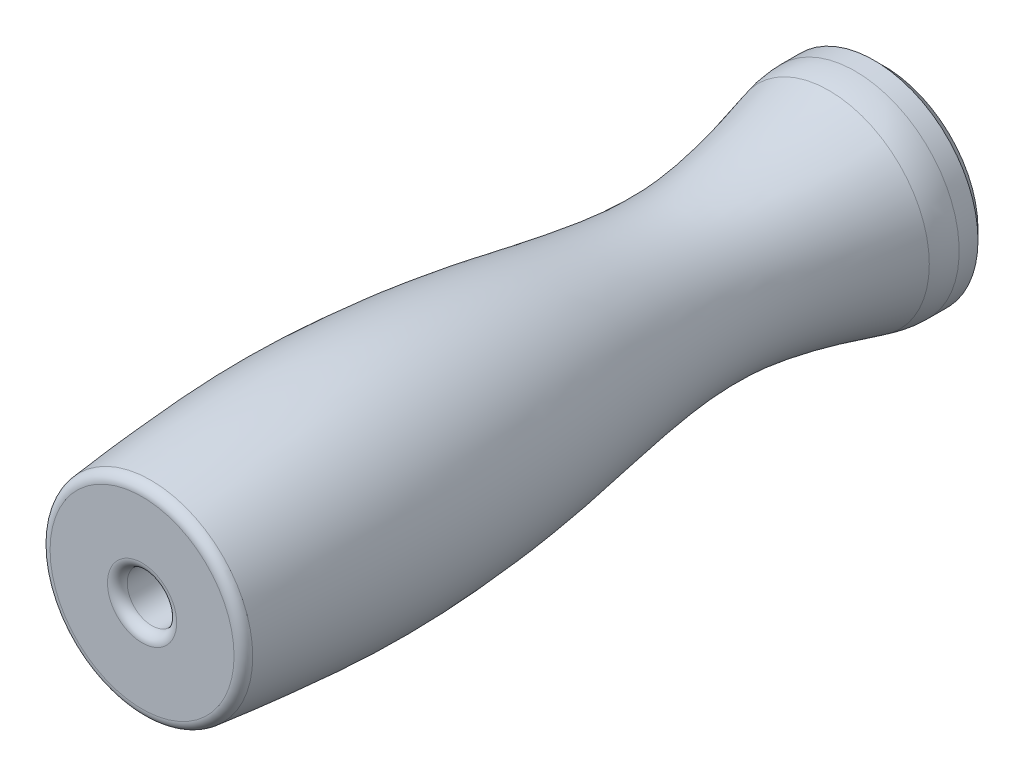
ISO-10303-21;
HEADER;
FILE_DESCRIPTION(('STEP AP214'),'2;1');
FILE_NAME('part.step','',(''),(''),'','','');
FILE_SCHEMA(('AUTOMOTIVE_DESIGN { 1 0 10303 214 1 1 1 1 }'));
ENDSEC;
DATA;
#1=APPLICATION_CONTEXT('core data for automotive mechanical design processes');
#2=APPLICATION_PROTOCOL_DEFINITION('international standard','automotive_design',2000,#1);
#3=PRODUCT_CONTEXT('',#1,'mechanical');
#4=PRODUCT('Part','Part','',(#3));
#5=PRODUCT_RELATED_PRODUCT_CATEGORY('part','',(#4));
#6=PRODUCT_DEFINITION_FORMATION('','',#4);
#7=PRODUCT_DEFINITION_CONTEXT('part definition',#1,'design');
#8=PRODUCT_DEFINITION('design','',#6,#7);
#9=PRODUCT_DEFINITION_SHAPE('','',#8);
#10=(LENGTH_UNIT() NAMED_UNIT(*) SI_UNIT(.MILLI.,.METRE.));
#11=(NAMED_UNIT(*) PLANE_ANGLE_UNIT() SI_UNIT($,.RADIAN.));
#12=(NAMED_UNIT(*) SI_UNIT($,.STERADIAN.) SOLID_ANGLE_UNIT());
#13=UNCERTAINTY_MEASURE_WITH_UNIT(LENGTH_MEASURE(1.E-05),#10,'distance_accuracy_value','');
#14=(GEOMETRIC_REPRESENTATION_CONTEXT(3) GLOBAL_UNCERTAINTY_ASSIGNED_CONTEXT((#13)) GLOBAL_UNIT_ASSIGNED_CONTEXT((#10,
#11,#12)) REPRESENTATION_CONTEXT('',''));
#15=CARTESIAN_POINT('',(0.,0.,0.));
#16=DIRECTION('',(0.,0.,1.));
#17=DIRECTION('',(1.,0.,0.));
#18=AXIS2_PLACEMENT_3D('',#15,#16,#17);
#19=CARTESIAN_POINT('',(0.,0.,2.90364135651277));
#20=DIRECTION('',(0.,0.,-1.));
#21=DIRECTION('',(-1.,0.,0.));
#22=AXIS2_PLACEMENT_3D('',#19,#20,#21);
#23=DEGENERATE_TOROIDAL_SURFACE('',#22,0.500000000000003,10.,.T.);
#24=CARTESIAN_POINT('',(0.,0.,5.5629508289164));
#25=DIRECTION('',(0.,0.,-1.));
#26=DIRECTION('',(-1.,0.,0.));
#27=AXIS2_PLACEMENT_3D('',#24,#25,#26);
#28=CIRCLE('',#27,10.1399208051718);
#29=CARTESIAN_POINT('',(-10.1399208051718,0.,5.5629508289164));
#30=VERTEX_POINT('',#29);
#31=EDGE_CURVE('E57',#30,#30,#28,.F.);
#32=ORIENTED_EDGE('',*,*,#31,.F.);
#33=EDGE_LOOP('',(#32));
#34=FACE_BOUND('',#33,.T.);
#35=CARTESIAN_POINT('',(0.,0.,2.90364135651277));
#36=DIRECTION('',(0.,0.,-1.));
#37=DIRECTION('',(-1.,0.,0.));
#38=AXIS2_PLACEMENT_3D('',#35,#36,#37);
#39=CIRCLE('',#38,10.5);
#40=CARTESIAN_POINT('',(-10.5,0.,2.90364135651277));
#41=VERTEX_POINT('',#40);
#42=EDGE_CURVE('E54',#41,#41,#39,.T.);
#43=ORIENTED_EDGE('',*,*,#42,.F.);
#44=EDGE_LOOP('',(#43));
#45=FACE_BOUND('',#44,.T.);
#46=ADVANCED_FACE('F29',(#34,#45),#23,.T.);
#47=CARTESIAN_POINT('',(0.,0.,75.));
#48=DIRECTION('',(0.,0.,1.));
#49=DIRECTION('',(1.,0.,0.));
#50=AXIS2_PLACEMENT_3D('',#47,#48,#49);
#51=PLANE('',#50);
#52=CARTESIAN_POINT('',(0.,0.,75.));
#53=DIRECTION('',(0.,0.,1.));
#54=DIRECTION('',(1.,0.,0.));
#55=AXIS2_PLACEMENT_3D('',#52,#53,#54);
#56=CIRCLE('',#55,9.29819046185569);
#57=CARTESIAN_POINT('',(9.29819046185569,0.,75.));
#58=VERTEX_POINT('',#57);
#59=EDGE_CURVE('E39',#58,#58,#56,.T.);
#60=ORIENTED_EDGE('',*,*,#59,.T.);
#61=EDGE_LOOP('',(#60));
#62=FACE_BOUND('',#61,.T.);
#63=CARTESIAN_POINT('',(0.,0.,75.));
#64=DIRECTION('',(0.,0.,1.));
#65=DIRECTION('',(1.,0.,0.));
#66=AXIS2_PLACEMENT_3D('',#63,#64,#65);
#67=CIRCLE('',#66,3.5);
#68=CARTESIAN_POINT('',(3.5,0.,75.));
#69=VERTEX_POINT('',#68);
#70=EDGE_CURVE('E43',#69,#69,#67,.F.);
#71=ORIENTED_EDGE('',*,*,#70,.T.);
#72=EDGE_LOOP('',(#71));
#73=FACE_BOUND('',#72,.T.);
#74=ADVANCED_FACE('F80',(#62,#73),#51,.T.);
#75=CARTESIAN_POINT('',(0.,0.,5.));
#76=DIRECTION('',(0.,0.,-1.));
#77=DIRECTION('',(-1.,0.,0.));
#78=AXIS2_PLACEMENT_3D('',#75,#76,#77);
#79=CYLINDRICAL_SURFACE('',#78,10.5);
#80=CARTESIAN_POINT('',(0.,0.,1.00000000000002));
#81=DIRECTION('',(0.,0.,1.));
#82=DIRECTION('',(1.,0.,0.));
#83=AXIS2_PLACEMENT_3D('',#80,#81,#82);
#84=CIRCLE('',#83,10.5);
#85=CARTESIAN_POINT('',(10.5,0.,1.00000000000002));
#86=VERTEX_POINT('',#85);
#87=EDGE_CURVE('E51',#86,#86,#84,.T.);
#88=ORIENTED_EDGE('',*,*,#87,.T.);
#89=EDGE_LOOP('',(#88));
#90=FACE_BOUND('',#89,.T.);
#91=ORIENTED_EDGE('',*,*,#42,.T.);
#92=EDGE_LOOP('',(#91));
#93=FACE_BOUND('',#92,.T.);
#94=ADVANCED_FACE('F83',(#90,#93),#79,.T.);
#95=CARTESIAN_POINT('',(0.,0.,0.));
#96=DIRECTION('',(0.,0.,1.));
#97=DIRECTION('',(1.,0.,0.));
#98=AXIS2_PLACEMENT_3D('',#95,#96,#97);
#99=PLANE('',#98);
#100=CARTESIAN_POINT('',(0.,0.,0.));
#101=DIRECTION('',(0.,0.,1.));
#102=DIRECTION('',(1.,0.,0.));
#103=AXIS2_PLACEMENT_3D('',#100,#101,#102);
#104=CIRCLE('',#103,9.49999999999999);
#105=CARTESIAN_POINT('',(9.49999999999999,0.,0.));
#106=VERTEX_POINT('',#105);
#107=EDGE_CURVE('E48',#106,#106,#104,.F.);
#108=ORIENTED_EDGE('',*,*,#107,.T.);
#109=EDGE_LOOP('',(#108));
#110=FACE_BOUND('',#109,.T.);
#111=CARTESIAN_POINT('',(0.,0.,0.));
#112=DIRECTION('',(0.,0.,1.));
#113=DIRECTION('',(1.,0.,0.));
#114=AXIS2_PLACEMENT_3D('',#111,#112,#113);
#115=CIRCLE('',#114,2.5);
#116=CARTESIAN_POINT('',(2.5,0.,0.));
#117=VERTEX_POINT('',#116);
#118=EDGE_CURVE('E60',#117,#117,#115,.T.);
#119=ORIENTED_EDGE('',*,*,#118,.T.);
#120=EDGE_LOOP('',(#119));
#121=FACE_BOUND('',#120,.T.);
#122=ADVANCED_FACE('F79',(#110,#121),#99,.F.);
#123=CARTESIAN_POINT('',(0.,0.,0.));
#124=DIRECTION('',(0.,0.,1.));
#125=DIRECTION('',(1.,0.,0.));
#126=AXIS2_PLACEMENT_3D('',#123,#124,#125);
#127=CYLINDRICAL_SURFACE('',#126,2.5);
#128=CARTESIAN_POINT('',(0.,0.,74.));
#129=DIRECTION('',(0.,0.,1.));
#130=DIRECTION('',(1.,0.,0.));
#131=AXIS2_PLACEMENT_3D('',#128,#129,#130);
#132=CIRCLE('',#131,2.5);
#133=CARTESIAN_POINT('',(2.5,0.,74.));
#134=VERTEX_POINT('',#133);
#135=EDGE_CURVE('E10',#134,#134,#132,.T.);
#136=ORIENTED_EDGE('',*,*,#135,.T.);
#137=EDGE_LOOP('',(#136));
#138=FACE_BOUND('',#137,.T.);
#139=ORIENTED_EDGE('',*,*,#118,.F.);
#140=EDGE_LOOP('',(#139));
#141=FACE_BOUND('',#140,.T.);
#142=ADVANCED_FACE('F75',(#138,#141),#127,.F.);
#143=CARTESIAN_POINT('',(10.6119045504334,0.,3.86488514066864));
#144=CARTESIAN_POINT('',(9.25475009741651,0.,8.72926156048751));
#145=CARTESIAN_POINT('',(6.22932852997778,0.,19.5731189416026));
#146=CARTESIAN_POINT('',(10.4404692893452,0.,38.1399594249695));
#147=CARTESIAN_POINT('',(12.0661248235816,0.,57.2210150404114));
#148=CARTESIAN_POINT('',(10.7038146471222,0.,70.1934634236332));
#149=CARTESIAN_POINT('',(10.1289648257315,0.,75.6674074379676));
#150=B_SPLINE_CURVE_WITH_KNOTS('',3,(#143,#144,#145,#146,#147,#148,#149),.UNSPECIFIED.,.F.,.F.,
(4,1,1,1,4),(0.,0.206466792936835,0.460263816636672,0.772249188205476,1.),.UNSPECIFIED.);
#151=CARTESIAN_POINT('',(0.,0.,0.));
#152=DIRECTION('',(0.,0.,-1.));
#153=AXIS1_PLACEMENT('',#151,#152);
#154=SURFACE_OF_REVOLUTION('',#150,#153);
#155=CARTESIAN_POINT('',(0.,0.,74.1037250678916));
#156=DIRECTION('',(0.,0.,-1.));
#157=DIRECTION('',(-1.,0.,0.));
#158=AXIS2_PLACEMENT_3D('',#155,#156,#157);
#159=CIRCLE('',#158,10.292796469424);
#160=CARTESIAN_POINT('',(-10.292796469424,0.,74.1037250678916));
#161=VERTEX_POINT('',#160);
#162=EDGE_CURVE('E35',#161,#161,#159,.T.);
#163=ORIENTED_EDGE('',*,*,#162,.T.);
#164=EDGE_LOOP('',(#163));
#165=FACE_BOUND('',#164,.T.);
#166=ORIENTED_EDGE('',*,*,#31,.T.);
#167=EDGE_LOOP('',(#166));
#168=FACE_BOUND('',#167,.T.);
#169=ADVANCED_FACE('F70',(#165,#168),#154,.F.);
#170=CARTESIAN_POINT('',(0.,0.,1.00000000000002));
#171=DIRECTION('',(0.,0.,1.));
#172=DIRECTION('',(1.,0.,0.));
#173=AXIS2_PLACEMENT_3D('',#170,#171,#172);
#174=CONICAL_SURFACE('',#173,10.5,0.785398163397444);
#175=ORIENTED_EDGE('',*,*,#107,.F.);
#176=EDGE_LOOP('',(#175));
#177=FACE_BOUND('',#176,.T.);
#178=ORIENTED_EDGE('',*,*,#87,.F.);
#179=EDGE_LOOP('',(#178));
#180=FACE_BOUND('',#179,.T.);
#181=ADVANCED_FACE('F74',(#177,#180),#174,.T.);
#182=CARTESIAN_POINT('',(0.,0.,74.));
#183=DIRECTION('',(0.,0.,-1.));
#184=DIRECTION('',(-1.,0.,0.));
#185=AXIS2_PLACEMENT_3D('',#182,#183,#184);
#186=TOROIDAL_SURFACE('',#185,9.29819046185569,1.);
#187=ORIENTED_EDGE('',*,*,#162,.F.);
#188=EDGE_LOOP('',(#187));
#189=FACE_BOUND('',#188,.T.);
#190=ORIENTED_EDGE('',*,*,#59,.F.);
#191=EDGE_LOOP('',(#190));
#192=FACE_BOUND('',#191,.T.);
#193=ADVANCED_FACE('F135',(#189,#192),#186,.T.);
#194=CARTESIAN_POINT('',(0.,0.,74.));
#195=DIRECTION('',(0.,0.,1.));
#196=DIRECTION('',(1.,0.,0.));
#197=AXIS2_PLACEMENT_3D('',#194,#195,#196);
#198=TOROIDAL_SURFACE('',#197,3.5,1.);
#199=ORIENTED_EDGE('',*,*,#70,.F.);
#200=EDGE_LOOP('',(#199));
#201=FACE_BOUND('',#200,.T.);
#202=ORIENTED_EDGE('',*,*,#135,.F.);
#203=EDGE_LOOP('',(#202));
#204=FACE_BOUND('',#203,.T.);
#205=ADVANCED_FACE('F144',(#201,#204),#198,.T.);
#206=CLOSED_SHELL('',(#46,#74,#94,#122,#142,#169,#181,#193,#205));
#207=MANIFOLD_SOLID_BREP('B2',#206);
#208=ADVANCED_BREP_SHAPE_REPRESENTATION('',(#18,#207),#14);
#209=SHAPE_DEFINITION_REPRESENTATION(#9,#208);
ENDSEC;
END-ISO-10303-21;
